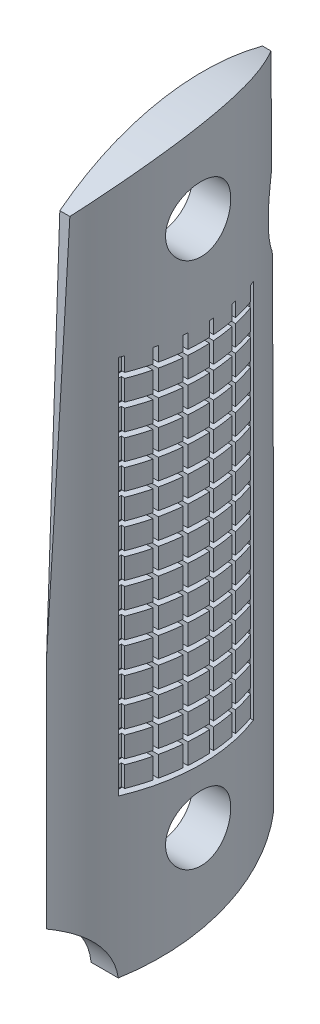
from build123d import *

# Parameters (mm, degrees)
SKETCH1_R           = 4.826
BOSS_EXTRUDE1_DEPTH = 6.096
CUT_EXTRUDE2_DEPTH  = 131.318
SKETCH4_W           = 0.630391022
SKETCH4_H           = 56.232060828
CUT_EXTRUDE3_DEPTH  = 8.89
LPATTERN1_COUNT     = 6
LPATTERN1_PITCH     = 3.81
CUT_EXTRUDE4_START  = 3.175
SKETCH6_W           = 19.680391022
SKETCH6_H           = 0.762
CUT_EXTRUDE4_DEPTH  = 8.89
LPATTERN2_COUNT     = 15
LPATTERN2_PITCH     = 3.81


with BuildPart() as part:
    # Sketch1 → Boss-Extrude1 (new body)
    with BuildSketch(Plane(origin=(0, 0, 0), x_dir=(0, 0, -1), z_dir=(1, 0, 0))):
        with BuildLine():
            Line((-10.201911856, -15.152208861), (17.998743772, -9.157974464))
            Line((17.998743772, -9.157974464), (15.924023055, 63.286089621))
            ThreePointArc((15.924023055, 63.286089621), (13.973747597, 68.673832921), (15.612480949, 74.164361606))
            Line((15.612480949, 74.164361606), (15.16942447, 89.634786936))
            ThreePointArc((15.16942447, 89.634786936), (-0.544687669, 90.084547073), (-14.830877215, 83.52402935))
            Line((-14.830877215, 83.52402935), (-17.997789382, -7.40296774))
            ThreePointArc((-17.997789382, -7.40296774), (-12.70777337, -9.877133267), (-10.201911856, -15.152208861))
        make_face()
        with Locations(Location((0, 0, 0), (0, 0, 180))):
            Circle(SKETCH1_R, mode=Mode.SUBTRACT)
        with Locations(Location((0, 78.0796, 0), (0, 0, 180))):
            Circle(SKETCH1_R, mode=Mode.SUBTRACT)
    extrude(amount=BOSS_EXTRUDE1_DEPTH)

    # Sketch3 → Cut-Extrude2 (cut)
    with BuildSketch(Plane(origin=(0, 96.52, 0), x_dir=(-1, 0, 0), z_dir=(0, 1, 0))):
        with BuildLine():
            Line((0, -16.787075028), (-21.543114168, -16.787075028))
            Line((-21.543114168, -16.787075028), (-21.543114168, 16.787075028))
            Line((-21.543114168, 16.787075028), (0, 16.787075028))
            ThreePointArc((0, 16.787075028), (-6.096, 0), (0, -16.787075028))
        make_face()
    extrude(amount=-CUT_EXTRUDE2_DEPTH, mode=Mode.SUBTRACT)


with BuildPart() as body_2:
    # of the pieces the cut leaves, the one that is kept (cut_extrude2_keep)
    add(part.part.solids().sort_by_distance((0, 83.52402935, 14.830877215))[0])

    # Sketch4 → Cut-Extrude3 (cut)
    with BuildSketch(Plane(origin=(12.7, 0, 0), x_dir=(0, 0, -1), z_dir=(1, 0, 0))):
        with Locations((-9.844804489, 36.291516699)):
            Rectangle(SKETCH4_W, SKETCH4_H)
    cut_extrude3 = extrude(amount=-CUT_EXTRUDE3_DEPTH, mode=Mode.SUBTRACT)

    # LPattern1: Cut-Extrude3 ×6
    with Locations(*[(0, 0, -i * LPATTERN1_PITCH) for i in range(1, LPATTERN1_COUNT)]):
        add(cut_extrude3, mode=Mode.SUBTRACT)

    # Sketch6 → Cut-Extrude4 (cut)
    with BuildSketch(Plane(origin=(0, 0, 0), x_dir=(0, 0, -1), z_dir=(1, 0, 0)).offset(CUT_EXTRUDE4_START)):
        with Locations((-0.319804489, 8.556486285)):
            Rectangle(SKETCH6_W, SKETCH6_H)
    cut_extrude4 = extrude(amount=CUT_EXTRUDE4_DEPTH, mode=Mode.SUBTRACT)

    # LPattern2: Cut-Extrude4 ×15
    with Locations(*[(0, i * LPATTERN2_PITCH, 0) for i in range(1, LPATTERN2_COUNT)]):
        add(cut_extrude4, mode=Mode.SUBTRACT)


solid = body_2.part
